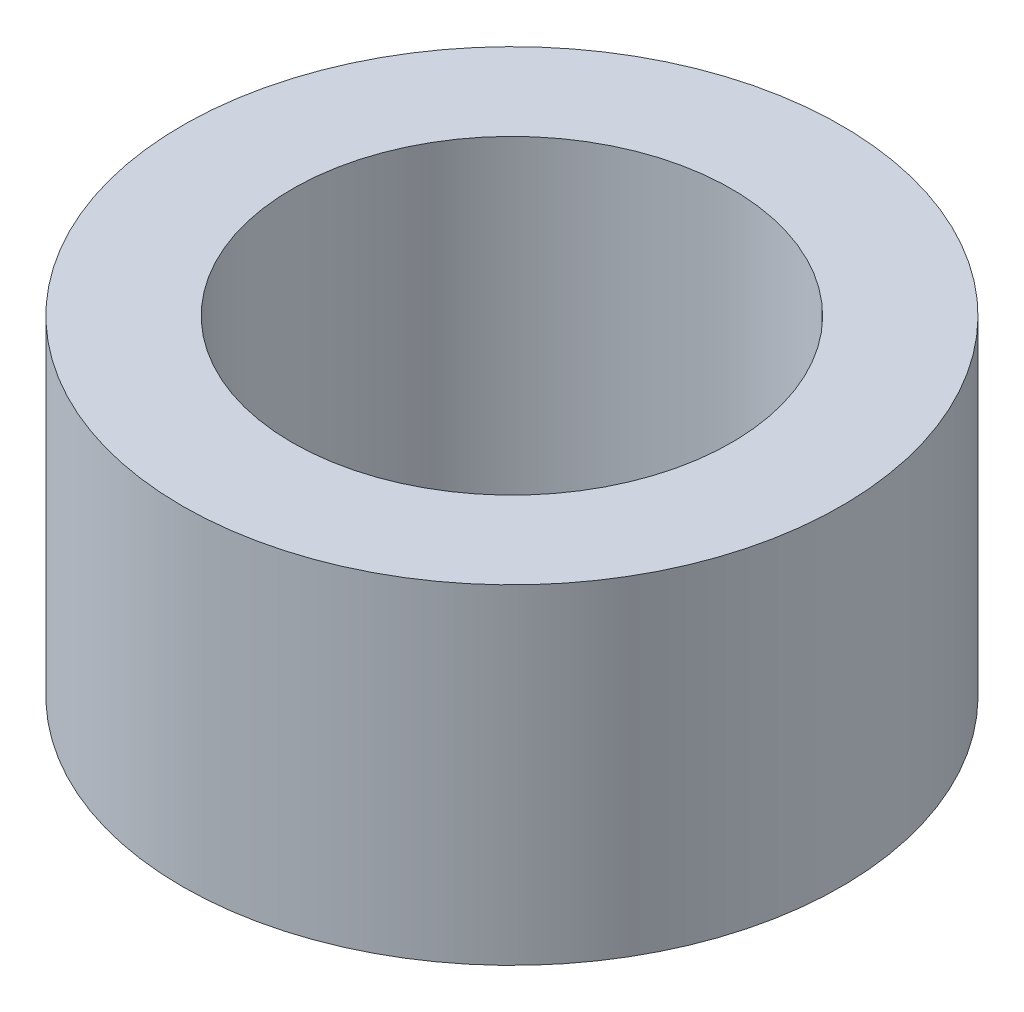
from build123d import *

# Parameters (mm, degrees)
SKETCH1_R           = 1.5
SKETCH1_R_2         = 1
BOSS_EXTRUDE1_DEPTH = 1.5


with BuildPart() as part:
    # Sketch1 → Boss-Extrude1 (new body)
    with BuildSketch(Plane(origin=(0, 0, 0), x_dir=(1, 0, 0), z_dir=(0, 1, 0))):
        with Locations(Location((0, 0, 0), (0, 0, 270))):
            Circle(SKETCH1_R)
        with Locations(Location((0, 0, 0), (0, 0, 270))):
            Circle(SKETCH1_R_2, mode=Mode.SUBTRACT)
    extrude(amount=BOSS_EXTRUDE1_DEPTH)


solid = part.part
